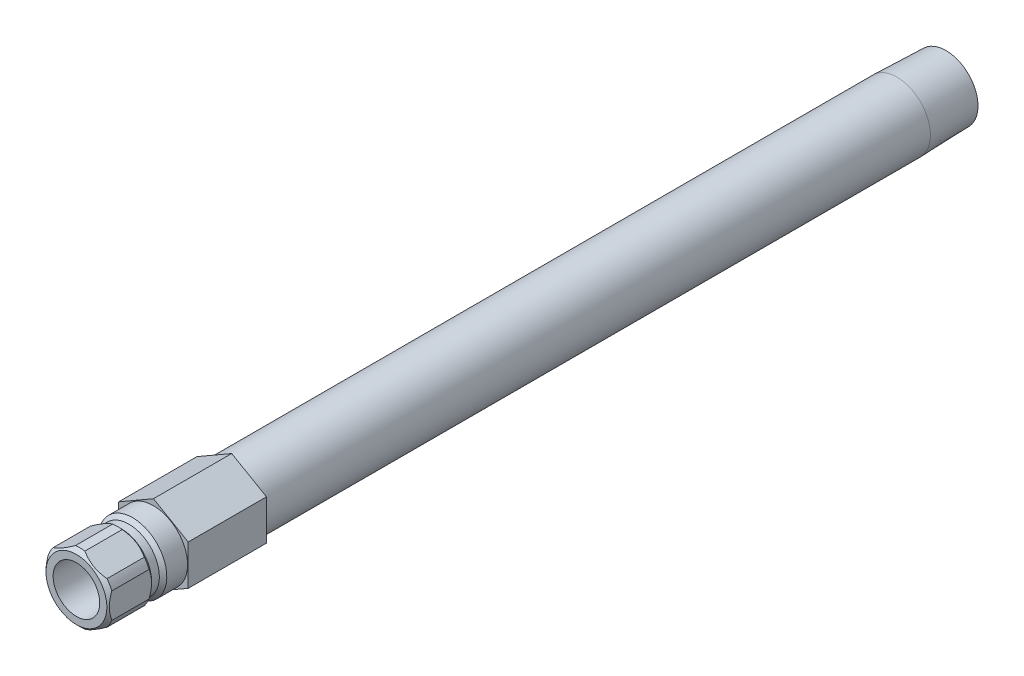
from build123d import *

# Parameters (mm, degrees)
SKETCH2_R           = 4.6228
BOSS_EXTRUDE1_DEPTH = 16.002
CUT_EXTRUDE1_START  = 6.604
SKETCH3_OUTSIDE_W   = 52.048
SKETCH3_OUTSIDE_H   = 54.248
CUT_EXTRUDE1_DEPTH  = 156.811738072


with BuildPart() as part:
    # Sketch1 → Revolve1 (revolve)
    with BuildSketch(Plane(origin=(0, 0, 0), x_dir=(0, 0, -1), z_dir=(1, 0, 0))):
        Polygon((-15.748, 4.7625), (-15.748, 6.223), (-14.986, 6.985), (-7.366, 6.985), (-6.604, 6.223), (-5.0165, 6.223), (-4.2545, 6.985), (0, 6.985), (0, 6.858), (152.019, 6.858), (162.052, 6.544470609), (162.052, 4.6228), (-3.481720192, 4.6228), (-3.556, 4.7625), align=None)
    revolve(axis=Axis((0, 0, 12.87483316), (0, 0, 1)))

    # Sketch2 → Boss-Extrude1 (add)
    with BuildSketch(Plane.XY):
        Polygon((-7.112, 4.106115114), (-7.112, -4.106115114), (0, -8.212230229), (7.112, -4.106115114), (7.112, 4.106115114), (0, 8.212230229), align=None)
        with Locations(Location((0, 0, 0), (0, 0, 90))):
            Circle(SKETCH2_R, mode=Mode.SUBTRACT)
    extrude(amount=-BOSS_EXTRUDE1_DEPTH)

    # Sketch3 outside → Cut-Extrude1 (cut, through all)
    with BuildSketch(Plane.XY.offset(CUT_EXTRUDE1_START)):
        Rectangle(SKETCH3_OUTSIDE_W, SKETCH3_OUTSIDE_H)
        Polygon((6.477, -3.739497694), (6.477, 3.739497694), (0, 7.478995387), (-6.477, 3.739497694), (-6.477, -3.739497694), (0, -7.478995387), align=None, mode=Mode.SUBTRACT)
    extrude(amount=CUT_EXTRUDE1_DEPTH, mode=Mode.SUBTRACT)


solid = part.part
